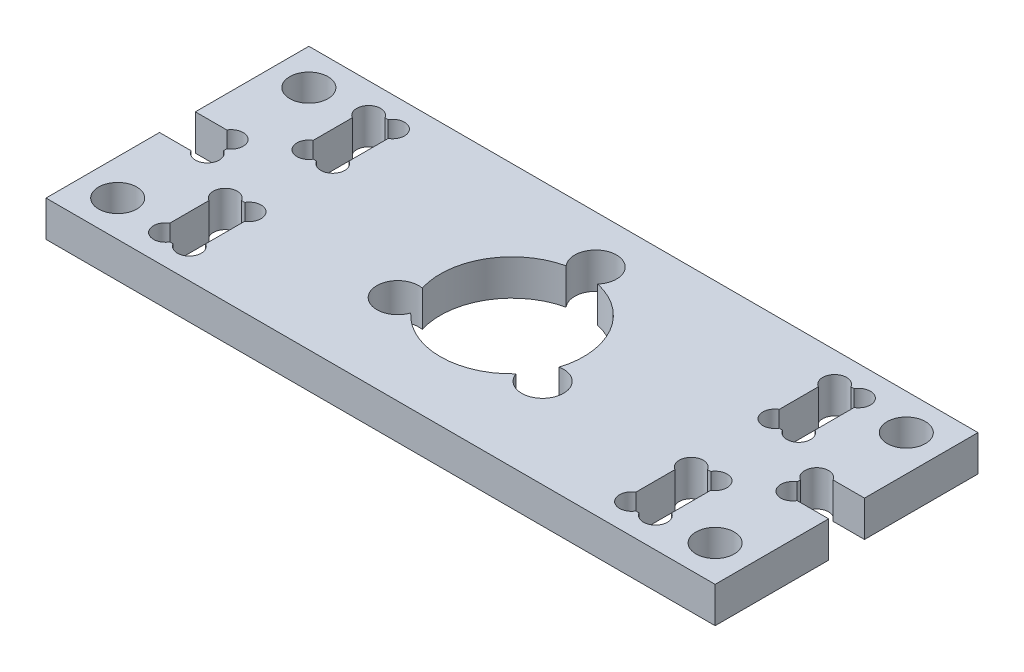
from build123d import *

# Parameters (mm, degrees)
SKETCH_1_W              = 56
SKETCH_1_H              = 22
EXTRUDE_1_DEPTH         = 3
HOLE_WIZARD_3_2_3_2_1_D = 3.2
SKETCH_4_R              = 6
CUT_EXTRUDE_1_DEPTH     = 31.232432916
SKETCH_5_W              = 3
SKETCH_5_H              = 6
SKETCH_5_W_2            = 4
SKETCH_5_H_2            = 3
CUT_EXTRUDE_2_DEPTH     = 31.232432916
HOLE_WIZARD_2_0_2_1_D   = 2
HOLE_WIZARD_3_5_3_5_1_D = 3.5


with BuildPart() as part:
    # Sketch 1 → Extrude 1 (new body)
    with BuildSketch(Plane(origin=(0, 0, 0), x_dir=(1, 0, 0), z_dir=(0, 1, 0))):
        Rectangle(SKETCH_1_W, SKETCH_1_H)
    extrude(amount=EXTRUDE_1_DEPTH)

    # Hole Wizard 3.2 _3.2_ _1 (through all)
    with Locations(Plane(origin=(0, 3, 0), x_dir=(1, 0, 0), z_dir=(0, 1, 0))):
        with Locations((-25, -8), (-25, 8), (25, 8), (25, -8)):
            Hole(HOLE_WIZARD_3_2_3_2_1_D / 2)

    # Sketch 4 → Cut-Extrude 1 (cut, through all)
    with BuildSketch(Plane(origin=(0, 3, 0), x_dir=(1, 0, 0), z_dir=(0, 1, 0))):
        with Locations(Location((0, 0, 0), (0, 0, 270))):
            Circle(SKETCH_4_R)
    extrude(amount=-CUT_EXTRUDE_1_DEPTH, mode=Mode.SUBTRACT)

    # Sketch 5 → Cut-Extrude 2 (cut, through all)
    with BuildSketch(Plane(origin=(0, 3, 0), x_dir=(1, 0, 0), z_dir=(0, 1, 0))):
        with Locations((-19.5, 6)):
            Rectangle(SKETCH_5_W, SKETCH_5_H)
        with Locations((-19.5, -6)):
            Rectangle(SKETCH_5_W, SKETCH_5_H)
        with Locations((19.5, -6)):
            Rectangle(SKETCH_5_W, SKETCH_5_H)
        with Locations((19.5, 6)):
            Rectangle(SKETCH_5_W, SKETCH_5_H)
        with Locations((26, 0)):
            Rectangle(SKETCH_5_W_2, SKETCH_5_H_2)
        with Locations((-26, 0)):
            Rectangle(SKETCH_5_W_2, SKETCH_5_H_2)
    extrude(amount=-CUT_EXTRUDE_2_DEPTH, mode=Mode.SUBTRACT)

    # Hole Wizard 2.0 _2_ _1 (through all)
    with Locations(Plane(origin=(0, 3, 0), x_dir=(1, 0, 0), z_dir=(0, 1, 0))):
        with Locations((20.5, 8.5), (-20.5, 8.5), (-18.5, 8.5), (-18.5, 3.5), (-20.5, 3.5), (-24.5, 1), (-24.5, -1), (-20.5, -3.5), (-18.5, -3.5), (-18.5, -8.5), (-20.5, -8.5), (24.5, -1), (24.5, 1), (20.5, -8.5), (18.5, -8.5), (18.5, -3.5), (20.5, -3.5), (20.5, 3.5), (18.5, 3.5), (18.5, 8.5)):
            Hole(HOLE_WIZARD_2_0_2_1_D / 2)

    # Hole Wizard 3.5 _3.5_ _1 (through all)
    with Locations(Plane(origin=(0, 3, 0), x_dir=(1, 0, 0), z_dir=(0, 1, 0))):
        with Locations((-6.062177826, -3.5), (0, 7), (6.062177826, -3.5)):
            Hole(HOLE_WIZARD_3_5_3_5_1_D / 2)


solid = part.part
